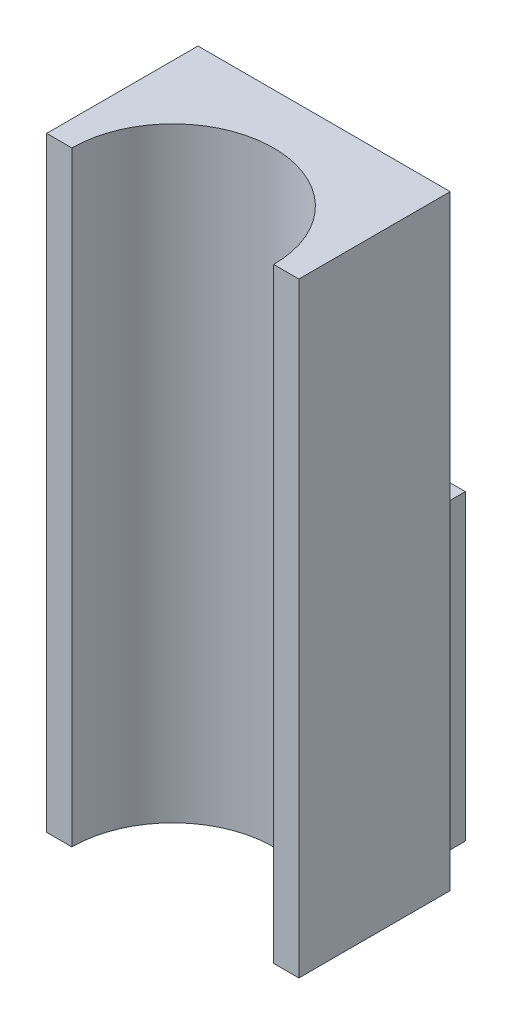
ISO-10303-21;
HEADER;
FILE_DESCRIPTION(('STEP AP214'),'2;1');
FILE_NAME('part.step','',(''),(''),'','','');
FILE_SCHEMA(('AUTOMOTIVE_DESIGN { 1 0 10303 214 1 1 1 1 }'));
ENDSEC;
DATA;
#1=APPLICATION_CONTEXT('core data for automotive mechanical design processes');
#2=APPLICATION_PROTOCOL_DEFINITION('international standard','automotive_design',2000,#1);
#3=PRODUCT_CONTEXT('',#1,'mechanical');
#4=PRODUCT('Part','Part','',(#3));
#5=PRODUCT_RELATED_PRODUCT_CATEGORY('part','',(#4));
#6=PRODUCT_DEFINITION_FORMATION('','',#4);
#7=PRODUCT_DEFINITION_CONTEXT('part definition',#1,'design');
#8=PRODUCT_DEFINITION('design','',#6,#7);
#9=PRODUCT_DEFINITION_SHAPE('','',#8);
#10=(LENGTH_UNIT() NAMED_UNIT(*) SI_UNIT(.MILLI.,.METRE.));
#11=(NAMED_UNIT(*) PLANE_ANGLE_UNIT() SI_UNIT($,.RADIAN.));
#12=(NAMED_UNIT(*) SI_UNIT($,.STERADIAN.) SOLID_ANGLE_UNIT());
#13=UNCERTAINTY_MEASURE_WITH_UNIT(LENGTH_MEASURE(1.E-05),#10,'distance_accuracy_value','');
#14=(GEOMETRIC_REPRESENTATION_CONTEXT(3) GLOBAL_UNCERTAINTY_ASSIGNED_CONTEXT((#13)) GLOBAL_UNIT_ASSIGNED_CONTEXT((#10,
#11,#12)) REPRESENTATION_CONTEXT('',''));
#15=CARTESIAN_POINT('',(0.,0.,0.));
#16=DIRECTION('',(0.,0.,1.));
#17=DIRECTION('',(1.,0.,0.));
#18=AXIS2_PLACEMENT_3D('',#15,#16,#17);
#19=CARTESIAN_POINT('',(0.,0.,8.));
#20=DIRECTION('',(0.,0.,1.));
#21=DIRECTION('',(1.,0.,0.));
#22=AXIS2_PLACEMENT_3D('',#19,#20,#21);
#23=PLANE('',#22);
#24=DIRECTION('',(1.,0.,0.));
#25=VECTOR('',#24,1.);
#26=CARTESIAN_POINT('',(-5.,-5.99999999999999,8.));
#27=LINE('',#26,#25);
#28=CARTESIAN_POINT('',(-5.,-5.99999999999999,8.));
#29=VERTEX_POINT('',#28);
#30=CARTESIAN_POINT('',(-4.00000000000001,-6.,8.));
#31=VERTEX_POINT('',#30);
#32=EDGE_CURVE('E147',#29,#31,#27,.T.);
#33=ORIENTED_EDGE('',*,*,#32,.T.);
#34=DIRECTION('',(0.,1.,0.));
#35=VECTOR('',#34,1.);
#36=CARTESIAN_POINT('',(-3.99999999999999,-14.9442719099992,8.));
#37=LINE('',#36,#35);
#38=CARTESIAN_POINT('',(-4.,18.,8.));
#39=VERTEX_POINT('',#38);
#40=EDGE_CURVE('E126',#31,#39,#37,.T.);
#41=ORIENTED_EDGE('',*,*,#40,.T.);
#42=DIRECTION('',(-1.,0.,0.));
#43=VECTOR('',#42,1.);
#44=CARTESIAN_POINT('',(-5.,18.,8.));
#45=LINE('',#44,#43);
#46=CARTESIAN_POINT('',(-5.,18.,8.));
#47=VERTEX_POINT('',#46);
#48=EDGE_CURVE('E136',#39,#47,#45,.T.);
#49=ORIENTED_EDGE('',*,*,#48,.T.);
#50=DIRECTION('',(0.,-1.,0.));
#51=VECTOR('',#50,1.);
#52=CARTESIAN_POINT('',(-5.,18.,8.));
#53=LINE('',#52,#51);
#54=EDGE_CURVE('E141',#47,#29,#53,.T.);
#55=ORIENTED_EDGE('',*,*,#54,.T.);
#56=EDGE_LOOP('',(#33,#41,#49,#55));
#57=FACE_BOUND('',#56,.T.);
#58=ADVANCED_FACE('F39',(#57),#23,.T.);
#59=CARTESIAN_POINT('',(-3.6,-6.,2.));
#60=DIRECTION('',(0.,1.,0.));
#61=DIRECTION('',(0.,0.,1.));
#62=AXIS2_PLACEMENT_3D('',#59,#60,#61);
#63=PLANE('',#62);
#64=CARTESIAN_POINT('',(0.,-6.,8.));
#65=DIRECTION('',(0.,1.,0.));
#66=DIRECTION('',(0.,0.,1.));
#67=AXIS2_PLACEMENT_3D('',#64,#65,#66);
#68=CIRCLE('',#67,4.);
#69=CARTESIAN_POINT('',(4.,-6.,8.));
#70=VERTEX_POINT('',#69);
#71=EDGE_CURVE('E123',#31,#70,#68,.F.);
#72=ORIENTED_EDGE('',*,*,#71,.F.);
#73=ORIENTED_EDGE('',*,*,#32,.F.);
#74=DIRECTION('',(0.,0.,-1.));
#75=VECTOR('',#74,1.);
#76=CARTESIAN_POINT('',(-5.,-5.99999999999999,8.));
#77=LINE('',#76,#75);
#78=CARTESIAN_POINT('',(-5.,-5.99999999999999,2.));
#79=VERTEX_POINT('',#78);
#80=EDGE_CURVE('E170',#29,#79,#77,.T.);
#81=ORIENTED_EDGE('',*,*,#80,.T.);
#82=DIRECTION('',(1.,0.,0.));
#83=VECTOR('',#82,1.);
#84=CARTESIAN_POINT('',(-5.,-5.99999999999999,2.));
#85=LINE('',#84,#83);
#86=CARTESIAN_POINT('',(-3.6,-5.99999999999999,2.));
#87=VERTEX_POINT('',#86);
#88=EDGE_CURVE('E165',#79,#87,#85,.T.);
#89=ORIENTED_EDGE('',*,*,#88,.T.);
#90=DIRECTION('',(0.,0.,-1.));
#91=VECTOR('',#90,1.);
#92=CARTESIAN_POINT('',(-3.6,-6.,2.));
#93=LINE('',#92,#91);
#94=CARTESIAN_POINT('',(-3.6,-6.,0.));
#95=VERTEX_POINT('',#94);
#96=EDGE_CURVE('E194',#87,#95,#93,.T.);
#97=ORIENTED_EDGE('',*,*,#96,.T.);
#98=DIRECTION('',(1.,0.,0.));
#99=VECTOR('',#98,1.);
#100=CARTESIAN_POINT('',(-3.6,-6.,0.));
#101=LINE('',#100,#99);
#102=CARTESIAN_POINT('',(3.6,-6.,0.));
#103=VERTEX_POINT('',#102);
#104=EDGE_CURVE('E81',#95,#103,#101,.T.);
#105=ORIENTED_EDGE('',*,*,#104,.T.);
#106=DIRECTION('',(0.,0.,-1.));
#107=VECTOR('',#106,1.);
#108=CARTESIAN_POINT('',(3.6,-6.,2.));
#109=LINE('',#108,#107);
#110=CARTESIAN_POINT('',(3.6,-6.,2.));
#111=VERTEX_POINT('',#110);
#112=EDGE_CURVE('E62',#111,#103,#109,.T.);
#113=ORIENTED_EDGE('',*,*,#112,.F.);
#114=CARTESIAN_POINT('',(5.,-5.99999999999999,2.));
#115=VERTEX_POINT('',#114);
#116=EDGE_CURVE('E161',#111,#115,#85,.T.);
#117=ORIENTED_EDGE('',*,*,#116,.T.);
#118=DIRECTION('',(0.,0.,-1.));
#119=VECTOR('',#118,1.);
#120=CARTESIAN_POINT('',(5.,-5.99999999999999,8.));
#121=LINE('',#120,#119);
#122=CARTESIAN_POINT('',(5.,-5.99999999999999,8.));
#123=VERTEX_POINT('',#122);
#124=EDGE_CURVE('E153',#123,#115,#121,.T.);
#125=ORIENTED_EDGE('',*,*,#124,.F.);
#126=EDGE_CURVE('E144',#70,#123,#27,.T.);
#127=ORIENTED_EDGE('',*,*,#126,.F.);
#128=EDGE_LOOP('',(#72,#73,#81,#89,#97,#105,#113,#117,#125,#127));
#129=FACE_BOUND('',#128,.T.);
#130=ADVANCED_FACE('F206',(#129),#63,.F.);
#131=CARTESIAN_POINT('',(-5.,18.,8.));
#132=DIRECTION('',(0.,-1.,0.));
#133=DIRECTION('',(1.,0.,0.));
#134=AXIS2_PLACEMENT_3D('',#131,#132,#133);
#135=PLANE('',#134);
#136=CARTESIAN_POINT('',(0.,18.,8.));
#137=DIRECTION('',(0.,1.,0.));
#138=DIRECTION('',(1.,0.,0.));
#139=AXIS2_PLACEMENT_3D('',#136,#137,#138);
#140=CIRCLE('',#139,4.);
#141=CARTESIAN_POINT('',(3.99999999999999,18.,8.));
#142=VERTEX_POINT('',#141);
#143=EDGE_CURVE('E53',#142,#39,#140,.T.);
#144=ORIENTED_EDGE('',*,*,#143,.F.);
#145=CARTESIAN_POINT('',(5.,18.,8.));
#146=VERTEX_POINT('',#145);
#147=EDGE_CURVE('E133',#146,#142,#45,.T.);
#148=ORIENTED_EDGE('',*,*,#147,.F.);
#149=DIRECTION('',(0.,0.,-1.));
#150=VECTOR('',#149,1.);
#151=CARTESIAN_POINT('',(5.,18.,8.));
#152=LINE('',#151,#150);
#153=CARTESIAN_POINT('',(5.,18.,2.));
#154=VERTEX_POINT('',#153);
#155=EDGE_CURVE('E172',#146,#154,#152,.T.);
#156=ORIENTED_EDGE('',*,*,#155,.T.);
#157=DIRECTION('',(-1.,0.,0.));
#158=VECTOR('',#157,1.);
#159=CARTESIAN_POINT('',(-5.,18.,2.));
#160=LINE('',#159,#158);
#161=CARTESIAN_POINT('',(-5.,18.,2.));
#162=VERTEX_POINT('',#161);
#163=EDGE_CURVE('E160',#154,#162,#160,.T.);
#164=ORIENTED_EDGE('',*,*,#163,.T.);
#165=DIRECTION('',(0.,0.,-1.));
#166=VECTOR('',#165,1.);
#167=CARTESIAN_POINT('',(-5.,18.,8.));
#168=LINE('',#167,#166);
#169=EDGE_CURVE('E168',#47,#162,#168,.T.);
#170=ORIENTED_EDGE('',*,*,#169,.F.);
#171=ORIENTED_EDGE('',*,*,#48,.F.);
#172=EDGE_LOOP('',(#144,#148,#156,#164,#170,#171));
#173=FACE_BOUND('',#172,.T.);
#174=ADVANCED_FACE('F135',(#173),#135,.F.);
#175=CARTESIAN_POINT('',(3.6,6.,2.));
#176=DIRECTION('',(-1.,0.,0.));
#177=DIRECTION('',(0.,-1.,0.));
#178=AXIS2_PLACEMENT_3D('',#175,#176,#177);
#179=PLANE('',#178);
#180=DIRECTION('',(0.,1.,0.));
#181=VECTOR('',#180,1.);
#182=CARTESIAN_POINT('',(3.6,6.,0.));
#183=LINE('',#182,#181);
#184=CARTESIAN_POINT('',(3.6,6.,0.));
#185=VERTEX_POINT('',#184);
#186=EDGE_CURVE('E174',#103,#185,#183,.T.);
#187=ORIENTED_EDGE('',*,*,#186,.T.);
#188=DIRECTION('',(0.,0.,-1.));
#189=VECTOR('',#188,1.);
#190=CARTESIAN_POINT('',(3.6,6.,2.));
#191=LINE('',#190,#189);
#192=CARTESIAN_POINT('',(3.6,6.,2.));
#193=VERTEX_POINT('',#192);
#194=EDGE_CURVE('E11',#193,#185,#191,.T.);
#195=ORIENTED_EDGE('',*,*,#194,.F.);
#196=DIRECTION('',(0.,1.,0.));
#197=VECTOR('',#196,1.);
#198=CARTESIAN_POINT('',(3.6,6.,2.));
#199=LINE('',#198,#197);
#200=EDGE_CURVE('E179',#111,#193,#199,.T.);
#201=ORIENTED_EDGE('',*,*,#200,.F.);
#202=ORIENTED_EDGE('',*,*,#112,.T.);
#203=EDGE_LOOP('',(#187,#195,#201,#202));
#204=FACE_BOUND('',#203,.T.);
#205=ADVANCED_FACE('F41',(#204),#179,.F.);
#206=CARTESIAN_POINT('',(-3.6,6.,2.));
#207=DIRECTION('',(0.,-1.,0.));
#208=DIRECTION('',(0.,0.,-1.));
#209=AXIS2_PLACEMENT_3D('',#206,#207,#208);
#210=PLANE('',#209);
#211=DIRECTION('',(-1.,0.,0.));
#212=VECTOR('',#211,1.);
#213=CARTESIAN_POINT('',(-3.6,6.,0.));
#214=LINE('',#213,#212);
#215=CARTESIAN_POINT('',(-3.6,6.,0.));
#216=VERTEX_POINT('',#215);
#217=EDGE_CURVE('E183',#185,#216,#214,.T.);
#218=ORIENTED_EDGE('',*,*,#217,.T.);
#219=DIRECTION('',(0.,0.,-1.));
#220=VECTOR('',#219,1.);
#221=CARTESIAN_POINT('',(-3.6,6.,2.));
#222=LINE('',#221,#220);
#223=CARTESIAN_POINT('',(-3.6,6.,2.));
#224=VERTEX_POINT('',#223);
#225=EDGE_CURVE('E50',#224,#216,#222,.T.);
#226=ORIENTED_EDGE('',*,*,#225,.F.);
#227=DIRECTION('',(-1.,0.,0.));
#228=VECTOR('',#227,1.);
#229=CARTESIAN_POINT('',(-3.6,6.,2.));
#230=LINE('',#229,#228);
#231=EDGE_CURVE('E88',#193,#224,#230,.T.);
#232=ORIENTED_EDGE('',*,*,#231,.F.);
#233=ORIENTED_EDGE('',*,*,#194,.T.);
#234=EDGE_LOOP('',(#218,#226,#232,#233));
#235=FACE_BOUND('',#234,.T.);
#236=ADVANCED_FACE('F245',(#235),#210,.F.);
#237=CARTESIAN_POINT('',(-3.6,6.,2.));
#238=DIRECTION('',(1.,0.,0.));
#239=DIRECTION('',(0.,1.,0.));
#240=AXIS2_PLACEMENT_3D('',#237,#238,#239);
#241=PLANE('',#240);
#242=DIRECTION('',(0.,-1.,0.));
#243=VECTOR('',#242,1.);
#244=CARTESIAN_POINT('',(-3.6,6.,0.));
#245=LINE('',#244,#243);
#246=EDGE_CURVE('E190',#216,#95,#245,.T.);
#247=ORIENTED_EDGE('',*,*,#246,.T.);
#248=ORIENTED_EDGE('',*,*,#96,.F.);
#249=DIRECTION('',(0.,-1.,0.));
#250=VECTOR('',#249,1.);
#251=CARTESIAN_POINT('',(-3.6,6.,2.));
#252=LINE('',#251,#250);
#253=EDGE_CURVE('E177',#224,#87,#252,.T.);
#254=ORIENTED_EDGE('',*,*,#253,.F.);
#255=ORIENTED_EDGE('',*,*,#225,.T.);
#256=EDGE_LOOP('',(#247,#248,#254,#255));
#257=FACE_BOUND('',#256,.T.);
#258=ADVANCED_FACE('F198',(#257),#241,.F.);
#259=CARTESIAN_POINT('',(0.,0.,0.));
#260=DIRECTION('',(0.,0.,1.));
#261=DIRECTION('',(1.,0.,0.));
#262=AXIS2_PLACEMENT_3D('',#259,#260,#261);
#263=PLANE('',#262);
#264=ORIENTED_EDGE('',*,*,#186,.F.);
#265=ORIENTED_EDGE('',*,*,#104,.F.);
#266=ORIENTED_EDGE('',*,*,#246,.F.);
#267=ORIENTED_EDGE('',*,*,#217,.F.);
#268=EDGE_LOOP('',(#264,#265,#266,#267));
#269=FACE_BOUND('',#268,.T.);
#270=ADVANCED_FACE('F200',(#269),#263,.F.);
#271=CARTESIAN_POINT('',(0.,0.,2.));
#272=DIRECTION('',(0.,0.,1.));
#273=DIRECTION('',(1.,0.,0.));
#274=AXIS2_PLACEMENT_3D('',#271,#272,#273);
#275=PLANE('',#274);
#276=ORIENTED_EDGE('',*,*,#116,.F.);
#277=ORIENTED_EDGE('',*,*,#200,.T.);
#278=ORIENTED_EDGE('',*,*,#231,.T.);
#279=ORIENTED_EDGE('',*,*,#253,.T.);
#280=ORIENTED_EDGE('',*,*,#88,.F.);
#281=DIRECTION('',(0.,-1.,0.));
#282=VECTOR('',#281,1.);
#283=CARTESIAN_POINT('',(-5.,18.,2.));
#284=LINE('',#283,#282);
#285=EDGE_CURVE('E157',#162,#79,#284,.T.);
#286=ORIENTED_EDGE('',*,*,#285,.F.);
#287=ORIENTED_EDGE('',*,*,#163,.F.);
#288=DIRECTION('',(0.,1.,0.));
#289=VECTOR('',#288,1.);
#290=CARTESIAN_POINT('',(5.,18.,2.));
#291=LINE('',#290,#289);
#292=EDGE_CURVE('E152',#115,#154,#291,.T.);
#293=ORIENTED_EDGE('',*,*,#292,.F.);
#294=EDGE_LOOP('',(#276,#277,#278,#279,#280,#286,#287,#293));
#295=FACE_BOUND('',#294,.T.);
#296=ADVANCED_FACE('F204',(#295),#275,.F.);
#297=CARTESIAN_POINT('',(5.,18.,8.));
#298=DIRECTION('',(-1.,0.,0.));
#299=DIRECTION('',(0.,-1.,0.));
#300=AXIS2_PLACEMENT_3D('',#297,#298,#299);
#301=PLANE('',#300);
#302=ORIENTED_EDGE('',*,*,#292,.T.);
#303=ORIENTED_EDGE('',*,*,#155,.F.);
#304=DIRECTION('',(0.,1.,0.));
#305=VECTOR('',#304,1.);
#306=CARTESIAN_POINT('',(5.,18.,8.));
#307=LINE('',#306,#305);
#308=EDGE_CURVE('E143',#123,#146,#307,.T.);
#309=ORIENTED_EDGE('',*,*,#308,.F.);
#310=ORIENTED_EDGE('',*,*,#124,.T.);
#311=EDGE_LOOP('',(#302,#303,#309,#310));
#312=FACE_BOUND('',#311,.T.);
#313=ADVANCED_FACE('F208',(#312),#301,.F.);
#314=CARTESIAN_POINT('',(-5.,18.,8.));
#315=DIRECTION('',(1.,0.,0.));
#316=DIRECTION('',(0.,1.,0.));
#317=AXIS2_PLACEMENT_3D('',#314,#315,#316);
#318=PLANE('',#317);
#319=ORIENTED_EDGE('',*,*,#285,.T.);
#320=ORIENTED_EDGE('',*,*,#80,.F.);
#321=ORIENTED_EDGE('',*,*,#54,.F.);
#322=ORIENTED_EDGE('',*,*,#169,.T.);
#323=EDGE_LOOP('',(#319,#320,#321,#322));
#324=FACE_BOUND('',#323,.T.);
#325=ADVANCED_FACE('F215',(#324),#318,.F.);
#326=DIRECTION('',(0.,1.,0.));
#327=VECTOR('',#326,1.);
#328=CARTESIAN_POINT('',(4.00000000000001,-14.9442719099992,8.));
#329=LINE('',#328,#327);
#330=EDGE_CURVE('E124',#70,#142,#329,.T.);
#331=ORIENTED_EDGE('',*,*,#330,.F.);
#332=ORIENTED_EDGE('',*,*,#126,.T.);
#333=ORIENTED_EDGE('',*,*,#308,.T.);
#334=ORIENTED_EDGE('',*,*,#147,.T.);
#335=EDGE_LOOP('',(#331,#332,#333,#334));
#336=FACE_BOUND('',#335,.T.);
#337=ADVANCED_FACE('F138',(#336),#23,.T.);
#338=CARTESIAN_POINT('',(0.,-14.9442719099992,8.));
#339=DIRECTION('',(0.,1.,0.));
#340=DIRECTION('',(-1.,0.,0.));
#341=AXIS2_PLACEMENT_3D('',#338,#339,#340);
#342=CYLINDRICAL_SURFACE('',#341,4.);
#343=ORIENTED_EDGE('',*,*,#71,.T.);
#344=ORIENTED_EDGE('',*,*,#330,.T.);
#345=ORIENTED_EDGE('',*,*,#143,.T.);
#346=ORIENTED_EDGE('',*,*,#40,.F.);
#347=EDGE_LOOP('',(#343,#344,#345,#346));
#348=FACE_BOUND('',#347,.T.);
#349=ADVANCED_FACE('F121',(#348),#342,.F.);
#350=CLOSED_SHELL('',(#58,#130,#174,#205,#236,#258,#270,#296,#313,#325,#337,#349));
#351=MANIFOLD_SOLID_BREP('B2',#350);
#352=ADVANCED_BREP_SHAPE_REPRESENTATION('',(#18,#351),#14);
#353=SHAPE_DEFINITION_REPRESENTATION(#9,#352);
ENDSEC;
END-ISO-10303-21;
